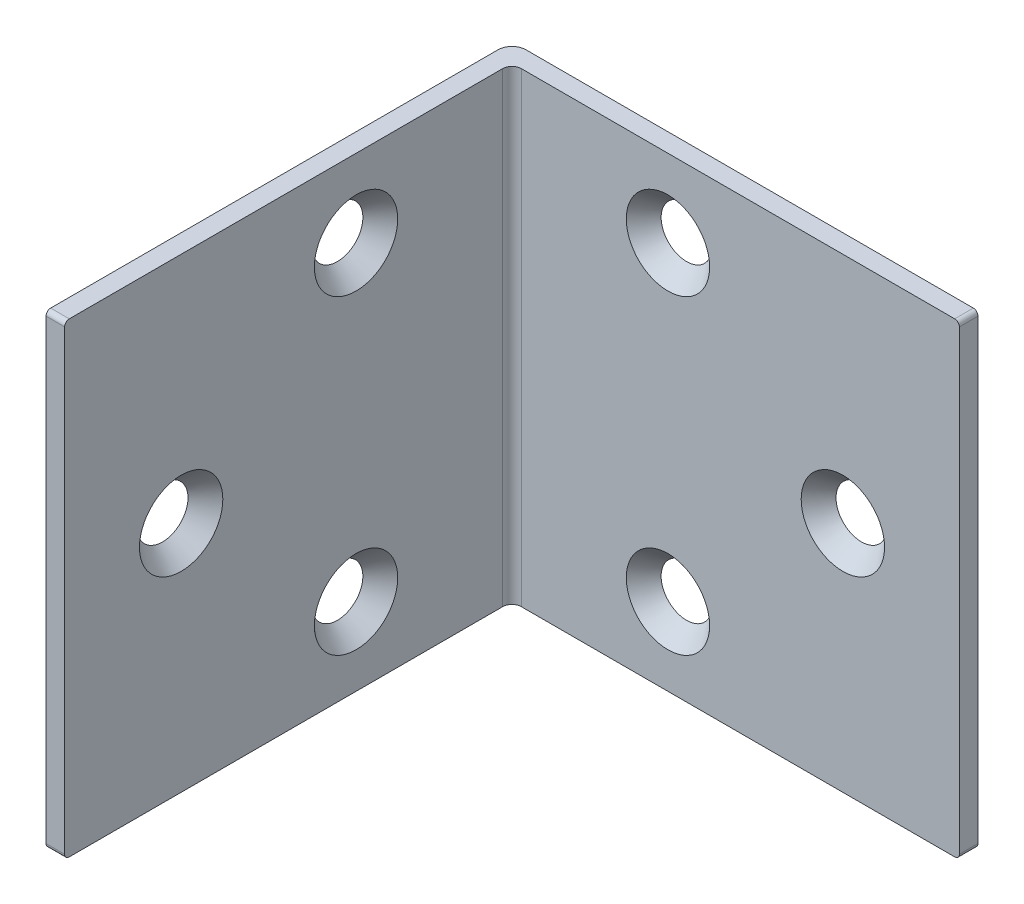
from build123d import *

# Parameters (mm, degrees)
BOSS_EXTRUDE1_DEPTH          = 19.05
FILLET1_R                    = 1.143
FILLET2_R                    = 0.762
FILLET3_R                    = 0.381
SKETCH4_R                    = 2.0828
CUT_EXTRUDE1_DEPTH           = 1.524
CUT_EXTRUDE1_DRAFT           = -41
CUT_EXTRUDE1_PROFILE_2_DEPTH = 1.524
CUT_EXTRUDE1_PROFILE_2_DRAFT = -41
CUT_EXTRUDE1_PROFILE_3_DEPTH = 1.524
CUT_EXTRUDE1_PROFILE_3_DRAFT = -41
SKETCH5_R                    = 2.0828
CUT_EXTRUDE2_DEPTH           = 1.524
CUT_EXTRUDE2_DRAFT           = -41
CUT_EXTRUDE2_PROFILE_2_DEPTH = 1.524
CUT_EXTRUDE2_PROFILE_2_DRAFT = -41
CUT_EXTRUDE2_PROFILE_3_DEPTH = 1.524
CUT_EXTRUDE2_PROFILE_3_DRAFT = -41


with BuildPart() as part:
    # Sketch3 → Boss-Extrude1 (new, symmetric)
    with BuildSketch(Plane(origin=(0, 0, 0), x_dir=(1, 0, 0), z_dir=(0, 1, 0))):
        Polygon((0.762, -0.762), (37.338, -0.762), (37.338, 0.762), (-0.762, 0.762), (-0.762, -37.338), (0.762, -37.338), align=None)
    extrude(amount=BOSS_EXTRUDE1_DEPTH, both=True)

    # Fillet1
    fillet1_edges = [part.edges().sort_by_distance(p)[0] for p in [
        (-0.762, 0, -0.762),
    ]]
    fillet(fillet1_edges, radius=FILLET1_R)

    # Fillet2
    fillet2_edges = [part.edges().sort_by_distance(p)[0] for p in [
        (0.762, 0, 0.762),
    ]]
    fillet(fillet2_edges, radius=FILLET2_R)

    # Fillet3
    fillet3_edges = [part.edges().sort_by_distance(p)[0] for p in [
        (37.338, 19.05, 0),
        (0, 19.05, 37.338),
        (0, -19.05, 37.338),
        (37.338, -19.05, 0),
    ]]
    fillet(fillet3_edges, radius=FILLET3_R)


with BuildPart() as cut_extrude1_tool:
    # Sketch4 → Cut-Extrude1 (with draft: the straight prism first)
    with BuildSketch(Plane(origin=(-0.762, 0, 0), x_dir=(0, 0, -1), z_dir=(1, 0, 0))):
        with Locations((-27.813, 0)):
            Circle(SKETCH4_R)
    extrude(amount=CUT_EXTRUDE1_DEPTH)
    # Cut-Extrude1: the draft: its side faces are tilted about the plane it starts from
    cut_extrude1_sides = [cut_extrude1_tool.faces().sort_by_distance(p)[0] for p in [
        (0, 0, 29.8958),
    ]]
    draft(cut_extrude1_sides, Plane(origin=(-0.762, 0, 0), x_dir=(0, 0, -1), z_dir=(1, 0, 0)), CUT_EXTRUDE1_DRAFT)


with BuildPart() as part_1:
    add(part.part)

    # Cut-Extrude1: cut by cut_extrude1_tool
    add(cut_extrude1_tool.part, mode=Mode.SUBTRACT)


with BuildPart() as cut_extrude1_profile_2_tool:
    # Sketch4 → Cut-Extrude1 profile 2 (with draft: the straight prism first)
    with BuildSketch(Plane(origin=(-0.762, 0, 0), x_dir=(0, 0, -1), z_dir=(1, 0, 0))):
        with Locations((-13.5128, 12.7)):
            Circle(SKETCH4_R)
    extrude(amount=CUT_EXTRUDE1_PROFILE_2_DEPTH)
    # Cut-Extrude1 profile 2: the draft: its side faces are tilted about the plane it starts from
    cut_extrude1_profile_2_sides = [cut_extrude1_profile_2_tool.faces().sort_by_distance(p)[0] for p in [
        (0, 12.7, 15.5956),
    ]]
    draft(cut_extrude1_profile_2_sides, Plane(origin=(-0.762, 0, 0), x_dir=(0, 0, -1), z_dir=(1, 0, 0)), CUT_EXTRUDE1_PROFILE_2_DRAFT)


with BuildPart() as part_2:
    add(part_1.part)

    # Cut-Extrude1 profile 2: cut by cut_extrude1_profile_2_tool
    add(cut_extrude1_profile_2_tool.part, mode=Mode.SUBTRACT)


with BuildPart() as cut_extrude1_profile_3_tool:
    # Sketch4 → Cut-Extrude1 profile 3 (with draft: the straight prism first)
    with BuildSketch(Plane(origin=(-0.762, 0, 0), x_dir=(0, 0, -1), z_dir=(1, 0, 0))):
        with Locations((-13.5128, -12.7)):
            Circle(SKETCH4_R)
    extrude(amount=CUT_EXTRUDE1_PROFILE_3_DEPTH)
    # Cut-Extrude1 profile 3: the draft: its side faces are tilted about the plane it starts from
    cut_extrude1_profile_3_sides = [cut_extrude1_profile_3_tool.faces().sort_by_distance(p)[0] for p in [
        (0, -12.7, 15.5956),
    ]]
    draft(cut_extrude1_profile_3_sides, Plane(origin=(-0.762, 0, 0), x_dir=(0, 0, -1), z_dir=(1, 0, 0)), CUT_EXTRUDE1_PROFILE_3_DRAFT)


with BuildPart() as part_3:
    add(part_2.part)

    # Cut-Extrude1 profile 3: cut by cut_extrude1_profile_3_tool
    add(cut_extrude1_profile_3_tool.part, mode=Mode.SUBTRACT)


with BuildPart() as cut_extrude2_tool:
    # Sketch5 → Cut-Extrude2 (with draft: the straight prism first)
    with BuildSketch(Plane.XY.offset(-0.762)):
        with Locations((13.5128, 12.7)):
            Circle(SKETCH5_R)
    extrude(amount=CUT_EXTRUDE2_DEPTH)
    # Cut-Extrude2: the draft: its side faces are tilted about the plane it starts from
    cut_extrude2_sides = [cut_extrude2_tool.faces().sort_by_distance(p)[0] for p in [
        (11.43, 12.7, 0),
    ]]
    draft(cut_extrude2_sides, Plane.XY.offset(-0.762), CUT_EXTRUDE2_DRAFT)


with BuildPart() as part_4:
    add(part_3.part)

    # Cut-Extrude2: cut by cut_extrude2_tool
    add(cut_extrude2_tool.part, mode=Mode.SUBTRACT)


with BuildPart() as cut_extrude2_profile_2_tool:
    # Sketch5 → Cut-Extrude2 profile 2 (with draft: the straight prism first)
    with BuildSketch(Plane.XY.offset(-0.762)):
        with Locations((13.5128, -12.7)):
            Circle(SKETCH5_R)
    extrude(amount=CUT_EXTRUDE2_PROFILE_2_DEPTH)
    # Cut-Extrude2 profile 2: the draft: its side faces are tilted about the plane it starts from
    cut_extrude2_profile_2_sides = [cut_extrude2_profile_2_tool.faces().sort_by_distance(p)[0] for p in [
        (11.43, -12.7, 0),
    ]]
    draft(cut_extrude2_profile_2_sides, Plane.XY.offset(-0.762), CUT_EXTRUDE2_PROFILE_2_DRAFT)


with BuildPart() as part_5:
    add(part_4.part)

    # Cut-Extrude2 profile 2: cut by cut_extrude2_profile_2_tool
    add(cut_extrude2_profile_2_tool.part, mode=Mode.SUBTRACT)


with BuildPart() as cut_extrude2_profile_3_tool:
    # Sketch5 → Cut-Extrude2 profile 3 (with draft: the straight prism first)
    with BuildSketch(Plane.XY.offset(-0.762)):
        with Locations((27.813, 0)):
            Circle(SKETCH5_R)
    extrude(amount=CUT_EXTRUDE2_PROFILE_3_DEPTH)
    # Cut-Extrude2 profile 3: the draft: its side faces are tilted about the plane it starts from
    cut_extrude2_profile_3_sides = [cut_extrude2_profile_3_tool.faces().sort_by_distance(p)[0] for p in [
        (25.7302, 0, 0),
    ]]
    draft(cut_extrude2_profile_3_sides, Plane.XY.offset(-0.762), CUT_EXTRUDE2_PROFILE_3_DRAFT)


with BuildPart() as part_6:
    add(part_5.part)

    # Cut-Extrude2 profile 3: cut by cut_extrude2_profile_3_tool
    add(cut_extrude2_profile_3_tool.part, mode=Mode.SUBTRACT)


solid = part_6.part
